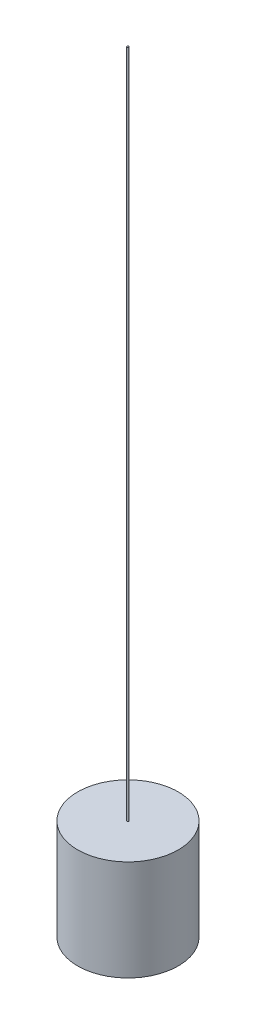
ISO-10303-21;
HEADER;
FILE_DESCRIPTION(('STEP AP214'),'2;1');
FILE_NAME('part.step','',(''),(''),'','','');
FILE_SCHEMA(('AUTOMOTIVE_DESIGN { 1 0 10303 214 1 1 1 1 }'));
ENDSEC;
DATA;
#1=APPLICATION_CONTEXT('core data for automotive mechanical design processes');
#2=APPLICATION_PROTOCOL_DEFINITION('international standard','automotive_design',2000,#1);
#3=PRODUCT_CONTEXT('',#1,'mechanical');
#4=PRODUCT('Part','Part','',(#3));
#5=PRODUCT_RELATED_PRODUCT_CATEGORY('part','',(#4));
#6=PRODUCT_DEFINITION_FORMATION('','',#4);
#7=PRODUCT_DEFINITION_CONTEXT('part definition',#1,'design');
#8=PRODUCT_DEFINITION('design','',#6,#7);
#9=PRODUCT_DEFINITION_SHAPE('','',#8);
#10=(LENGTH_UNIT() NAMED_UNIT(*) SI_UNIT(.MILLI.,.METRE.));
#11=(NAMED_UNIT(*) PLANE_ANGLE_UNIT() SI_UNIT($,.RADIAN.));
#12=(NAMED_UNIT(*) SI_UNIT($,.STERADIAN.) SOLID_ANGLE_UNIT());
#13=UNCERTAINTY_MEASURE_WITH_UNIT(LENGTH_MEASURE(1.E-05),#10,'distance_accuracy_value','');
#14=(GEOMETRIC_REPRESENTATION_CONTEXT(3) GLOBAL_UNCERTAINTY_ASSIGNED_CONTEXT((#13)) GLOBAL_UNIT_ASSIGNED_CONTEXT((#10,
#11,#12)) REPRESENTATION_CONTEXT('',''));
#15=CARTESIAN_POINT('',(0.,0.,0.));
#16=DIRECTION('',(0.,0.,1.));
#17=DIRECTION('',(1.,0.,0.));
#18=AXIS2_PLACEMENT_3D('',#15,#16,#17);
#19=CARTESIAN_POINT('',(0.,15.,0.));
#20=DIRECTION('',(0.,-1.,0.));
#21=DIRECTION('',(0.,0.,-1.));
#22=AXIS2_PLACEMENT_3D('',#19,#20,#21);
#23=CYLINDRICAL_SURFACE('',#22,7.5);
#24=CARTESIAN_POINT('',(0.,15.,0.));
#25=DIRECTION('',(0.,1.,0.));
#26=DIRECTION('',(0.,0.,1.));
#27=AXIS2_PLACEMENT_3D('',#24,#25,#26);
#28=CIRCLE('',#27,7.5);
#29=CARTESIAN_POINT('',(0.,15.,7.5));
#30=VERTEX_POINT('',#29);
#31=EDGE_CURVE('E10',#30,#30,#28,.T.);
#32=ORIENTED_EDGE('',*,*,#31,.F.);
#33=EDGE_LOOP('',(#32));
#34=FACE_BOUND('',#33,.T.);
#35=CARTESIAN_POINT('',(0.,0.,0.));
#36=DIRECTION('',(0.,1.,0.));
#37=DIRECTION('',(0.,0.,1.));
#38=AXIS2_PLACEMENT_3D('',#35,#36,#37);
#39=CIRCLE('',#38,7.5);
#40=CARTESIAN_POINT('',(0.,0.,7.5));
#41=VERTEX_POINT('',#40);
#42=EDGE_CURVE('E44',#41,#41,#39,.T.);
#43=ORIENTED_EDGE('',*,*,#42,.T.);
#44=EDGE_LOOP('',(#43));
#45=FACE_BOUND('',#44,.T.);
#46=ADVANCED_FACE('F41',(#34,#45),#23,.T.);
#47=CARTESIAN_POINT('',(0.,15.,0.));
#48=DIRECTION('',(0.,1.,0.));
#49=DIRECTION('',(0.,0.,1.));
#50=AXIS2_PLACEMENT_3D('',#47,#48,#49);
#51=PLANE('',#50);
#52=CARTESIAN_POINT('',(0.,15.,0.));
#53=DIRECTION('',(0.,1.,0.));
#54=DIRECTION('',(0.,0.,1.));
#55=AXIS2_PLACEMENT_3D('',#52,#53,#54);
#56=CIRCLE('',#55,0.131315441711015);
#57=CARTESIAN_POINT('',(0.,15.,0.131315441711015));
#58=VERTEX_POINT('',#57);
#59=EDGE_CURVE('E55',#58,#58,#56,.T.);
#60=ORIENTED_EDGE('',*,*,#59,.F.);
#61=EDGE_LOOP('',(#60));
#62=FACE_BOUND('',#61,.T.);
#63=ORIENTED_EDGE('',*,*,#31,.T.);
#64=EDGE_LOOP('',(#63));
#65=FACE_BOUND('',#64,.T.);
#66=ADVANCED_FACE('F72',(#62,#65),#51,.T.);
#67=CARTESIAN_POINT('',(0.,0.,0.));
#68=DIRECTION('',(0.,1.,0.));
#69=DIRECTION('',(0.,0.,1.));
#70=AXIS2_PLACEMENT_3D('',#67,#68,#69);
#71=PLANE('',#70);
#72=ORIENTED_EDGE('',*,*,#42,.F.);
#73=EDGE_LOOP('',(#72));
#74=FACE_BOUND('',#73,.T.);
#75=ADVANCED_FACE('F68',(#74),#71,.F.);
#76=CARTESIAN_POINT('',(0.,115.,0.));
#77=DIRECTION('',(0.,-1.,0.));
#78=DIRECTION('',(0.,0.,-1.));
#79=AXIS2_PLACEMENT_3D('',#76,#77,#78);
#80=CYLINDRICAL_SURFACE('',#79,0.131315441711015);
#81=CARTESIAN_POINT('',(0.,115.,0.));
#82=DIRECTION('',(0.,1.,0.));
#83=DIRECTION('',(0.,0.,1.));
#84=AXIS2_PLACEMENT_3D('',#81,#82,#83);
#85=CIRCLE('',#84,0.131315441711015);
#86=CARTESIAN_POINT('',(0.,115.,0.131315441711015));
#87=VERTEX_POINT('',#86);
#88=EDGE_CURVE('E53',#87,#87,#85,.T.);
#89=ORIENTED_EDGE('',*,*,#88,.F.);
#90=EDGE_LOOP('',(#89));
#91=FACE_BOUND('',#90,.T.);
#92=ORIENTED_EDGE('',*,*,#59,.T.);
#93=EDGE_LOOP('',(#92));
#94=FACE_BOUND('',#93,.T.);
#95=ADVANCED_FACE('F65',(#91,#94),#80,.T.);
#96=CARTESIAN_POINT('',(0.,115.,0.));
#97=DIRECTION('',(0.,1.,0.));
#98=DIRECTION('',(0.,0.,1.));
#99=AXIS2_PLACEMENT_3D('',#96,#97,#98);
#100=PLANE('',#99);
#101=ORIENTED_EDGE('',*,*,#88,.T.);
#102=EDGE_LOOP('',(#101));
#103=FACE_BOUND('',#102,.T.);
#104=ADVANCED_FACE('F63',(#103),#100,.T.);
#105=CLOSED_SHELL('',(#46,#66,#75,#95,#104));
#106=MANIFOLD_SOLID_BREP('B2',#105);
#107=ADVANCED_BREP_SHAPE_REPRESENTATION('',(#18,#106),#14);
#108=SHAPE_DEFINITION_REPRESENTATION(#9,#107);
ENDSEC;
END-ISO-10303-21;
